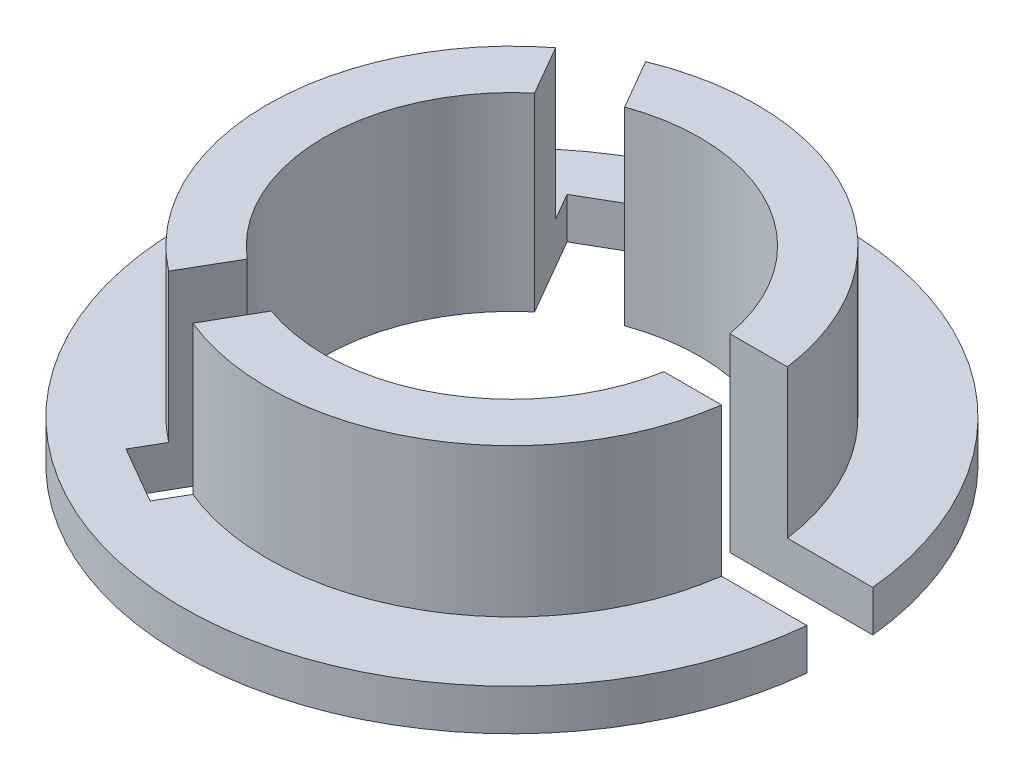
from build123d import *
from build123d.topology import SkipClean

# Parameters (mm, degrees)
SKETCH1_R           = 29.7
SKETCH1_R_2         = 22.8
BOSS_EXTRUDE1_DEPTH = 18
BOSS_EXTRUDE2_START = 5
SKETCH2_R           = 40
SKETCH2_R_2         = 22.8
BOSS_EXTRUDE2_DEPTH = 5
SKETCH3_W           = 16.525199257
SKETCH3_H           = 8
CUT_EXTRUDE1_DEPTH  = 62.065538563
SKETCH4_W           = 10.737001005
SKETCH4_H           = 8
CUT_EXTRUDE2_DEPTH  = 62.065538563


with BuildPart() as part:
    # Sketch1 → Boss-Extrude1 (new body)
    with BuildSketch(Plane(origin=(0, 0, 0), x_dir=(1, 0, 0), z_dir=(0, 1, 0))):
        with Locations(Location((0, 0, 0), (0, 0, 270))):
            Circle(SKETCH1_R)
        with Locations(Location((0, 0, 0), (0, 0, 270))):
            Circle(SKETCH1_R_2, mode=Mode.SUBTRACT)
    extrude(amount=BOSS_EXTRUDE1_DEPTH)

    # Sketch2 → Boss-Extrude2 (add)
    with SkipClean():  # the faces are left unmerged after this step: merging them gives an invalid solid
        with BuildSketch(Plane.XZ.offset(BOSS_EXTRUDE2_START)):
            with Locations(Location((0, 0, 0), (0, 0, 270))):
                Circle(SKETCH2_R)
            with Locations(Location((0, 0, 0), (0, 0, 270))):
                Circle(SKETCH2_R_2, mode=Mode.SUBTRACT)
        extrude(amount=-BOSS_EXTRUDE2_DEPTH)

    # Sketch3 → Cut-Extrude1 (cut, through all)
    with BuildSketch(Plane.XZ.offset(5)):
        Polygon((-13.145409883, -30.768517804), (-4.882810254, -16.457275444), (-11.811013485, -12.457275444), (-20.073613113, -26.768517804), align=None)
        with Locations((24.956423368, 0)):
            Rectangle(SKETCH3_W, SKETCH3_H)
        Polygon((-20.073613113, 26.768517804), (-11.811013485, 12.457275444), (-4.882810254, 16.457275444), (-13.145409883, 30.768517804), align=None)
    extrude(amount=-CUT_EXTRUDE1_DEPTH, mode=Mode.SUBTRACT)

    # Sketch4 → Cut-Extrude2 (cut, through all)
    with BuildSketch(Plane.XZ.offset(5)):
        with Locations((38.587523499, 0)):
            Rectangle(SKETCH4_W, SKETCH4_H)
    extrude(amount=-CUT_EXTRUDE2_DEPTH, mode=Mode.SUBTRACT)


solid = part.part
